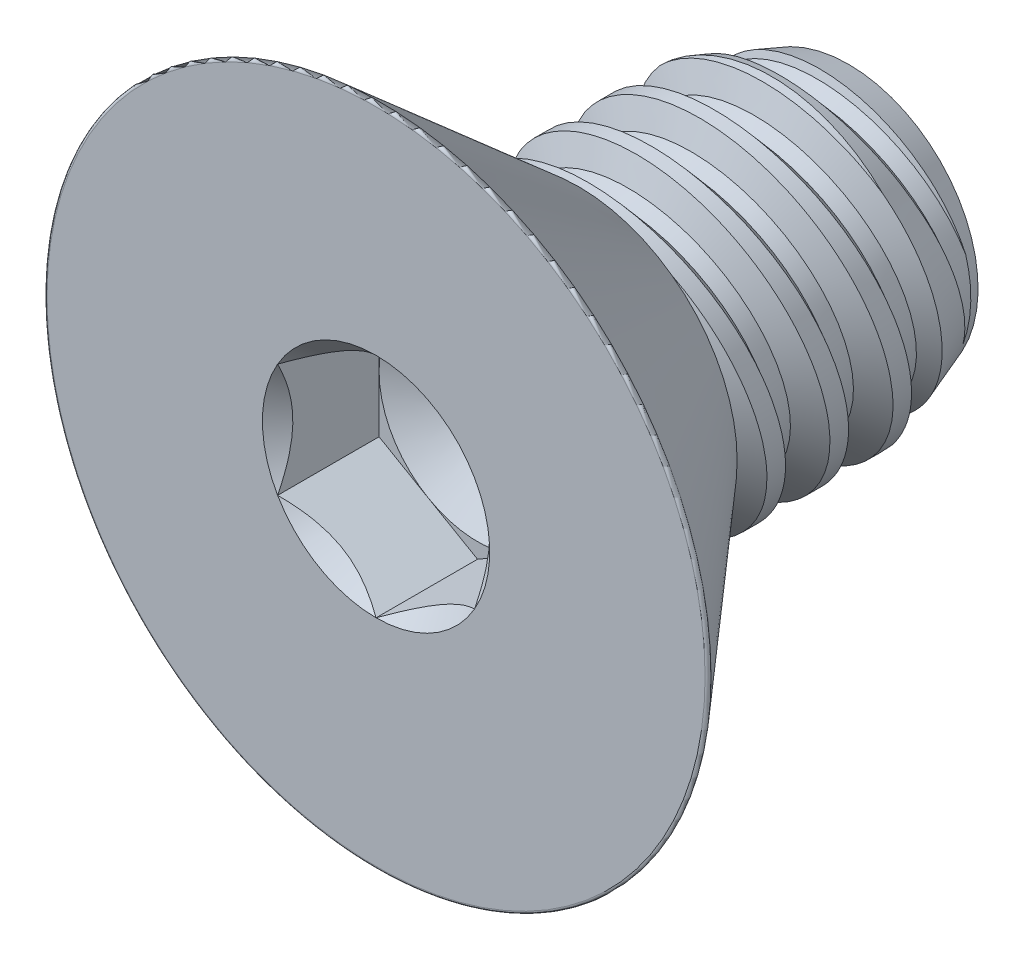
from build123d import *

# Parameters (mm, degrees)
SKETCH1_W          = 5.4356
SKETCH1_H          = 3.175
LPATTERN1_COUNT    = 4
LPATTERN1_PITCH    = 1.27
LPATTERN2_COUNT    = 2
LPATTERN2_PITCH    = 1.27
SKETCH4_R          = 6.7437
EXTRUDE1_DEPTH     = 4.0894
FILLET1_R          = 0.0508
CUT_EXTRUDE1_DEPTH = 2.0447
SKETCH7_R          = 2.291358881
CUT_EXTRUDE4_DEPTH = 2.0447
CUT_EXTRUDE4_DRAFT = -45
SKETCH8_R          = 1.984375
CUT_EXTRUDE5_DEPTH = 0.681566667
CUT_EXTRUDE5_DRAFT = -60


with BuildPart() as part:
    # Sketch1 → Revolve1 (revolve)
    with BuildSketch(Plane(origin=(0, 0, 0), x_dir=(0, 0, -1), z_dir=(1, 0, 0)), mode=Mode.PRIVATE) as revolve1_sk:
        with Locations((2.7178, 1.5875)):
            Rectangle(SKETCH1_W, SKETCH1_H)
    revolve(revolve1_sk.sketch.rotate(Axis((0, 0, 0), (0, 0, 1)), 270), axis=Axis((0, 0, 0), (0, 0, 1)))

    # Sketch2 → Cut-Revolve1 (revolve, cut)
    with BuildSketch(Plane(origin=(0, 0, 0), x_dir=(0, 0, -1), z_dir=(1, 0, 0)), mode=Mode.PRIVATE) as cut_revolve1_sk:
        Polygon((0.155667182, 3.206133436), (1.245337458, 3.424067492), (0.990981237, 2.672175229), (0.679646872, 2.609908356), align=None)
    cut_revolve1 = revolve(cut_revolve1_sk.sketch.rotate(Axis((0, -0.272704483, 0), (0, 0.19611613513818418, -0.9805806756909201)), 180), axis=Axis((0, -0.272704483, 0), (0, 0.19611613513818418, -0.9805806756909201)), mode=Mode.SUBTRACT)

    # Sketch3 → Cut-Revolve2 (revolve, cut)
    with BuildSketch(Plane(origin=(0, 0, 0), x_dir=(0, 0, -1), z_dir=(1, 0, 0)), mode=Mode.PRIVATE) as cut_revolve2_sk:
        Polygon((5.4356, 2.609908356), (3.883023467, 3.175), (5.4356, 3.175), align=None)
    revolve(cut_revolve2_sk.sketch.rotate(Axis((0, 0, -3.883023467), (0, 0, 1)), 270), axis=Axis((0, 0, -3.883023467), (0, 0, 1)), mode=Mode.SUBTRACT)

    # LPattern1: Cut-Revolve1 ×4
    with Locations(*[(0, 0, -i * LPATTERN1_PITCH) for i in range(1, LPATTERN1_COUNT)]):
        add(cut_revolve1, mode=Mode.SUBTRACT)

    # LPattern2: Cut-Revolve1 ×2
    with Locations(*[(0, 0, i * LPATTERN2_PITCH) for i in range(1, LPATTERN2_COUNT)]):
        add(cut_revolve1, mode=Mode.SUBTRACT)

    # Sketch4 → Extrude1 (add)
    with BuildSketch(Plane.XY):
        Circle(SKETCH4_R)
    extrude(amount=EXTRUDE1_DEPTH)

    # Sketch9 → Cut-Revolve3 (revolve, cut)
    with BuildSketch(Plane(origin=(0, 0, 0), x_dir=(0, 0, -1), z_dir=(1, 0, 0)), mode=Mode.PRIVATE) as cut_revolve3_sk:
        Polygon((-4.0894, 6.7437), (0, 3.188838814), (0, 6.7437), align=None)
    revolve(cut_revolve3_sk.sketch.rotate(Axis((0, 0, 0), (0, 0, 1)), 270), axis=Axis((0, 0, 0), (0, 0, 1)), mode=Mode.SUBTRACT)

    # Fillet1
    fillet1_edges = [part.edges().sort_by_distance(p)[0] for p in [
        (-6.7437, 0, 4.0894),
    ]]
    fillet(fillet1_edges, radius=FILLET1_R)

    # Sketch6 → Cut-Extrude1 (cut)
    with BuildSketch(Plane.XY.offset(4.0894)):
        Polygon((0, -2.291358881), (1.984375, -1.14567944), (1.984375, 1.14567944), (0, 2.291358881), (-1.984375, 1.14567944), (-1.984375, -1.14567944), align=None)
    extrude(amount=-CUT_EXTRUDE1_DEPTH, mode=Mode.SUBTRACT)


with BuildPart() as cut_extrude4_tool:
    # Sketch7 → Cut-Extrude4 (with draft: the straight prism first)
    with BuildSketch(Plane.XY.offset(4.0894)):
        Circle(SKETCH7_R)
    extrude(amount=-CUT_EXTRUDE4_DEPTH)
    # Cut-Extrude4: the draft: its side faces are tilted about the plane it starts from
    cut_extrude4_sides = [cut_extrude4_tool.faces().sort_by_distance(p)[0] for p in [
        (-2.291358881, 0, 3.06705),
    ]]
    draft(cut_extrude4_sides, Plane.XY.offset(4.0894), CUT_EXTRUDE4_DRAFT)


with BuildPart() as part_1:
    add(part.part)

    # Cut-Extrude4: cut by cut_extrude4_tool
    add(cut_extrude4_tool.part, mode=Mode.SUBTRACT)


with BuildPart() as cut_extrude5_tool:
    # Sketch8 → Cut-Extrude5 (with draft: the straight prism first)
    with BuildSketch(Plane.XY.offset(2.0447)):
        Circle(SKETCH8_R)
    extrude(amount=-CUT_EXTRUDE5_DEPTH)
    # Cut-Extrude5: the draft: its side faces are tilted about the plane it starts from
    cut_extrude5_sides = [cut_extrude5_tool.faces().sort_by_distance(p)[0] for p in [
        (-1.984375, 0, 1.703916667),
    ]]
    draft(cut_extrude5_sides, Plane.XY.offset(2.0447), CUT_EXTRUDE5_DRAFT)


with BuildPart() as part_2:
    add(part_1.part)

    # Cut-Extrude5: cut by cut_extrude5_tool
    add(cut_extrude5_tool.part, mode=Mode.SUBTRACT)


solid = part_2.part
